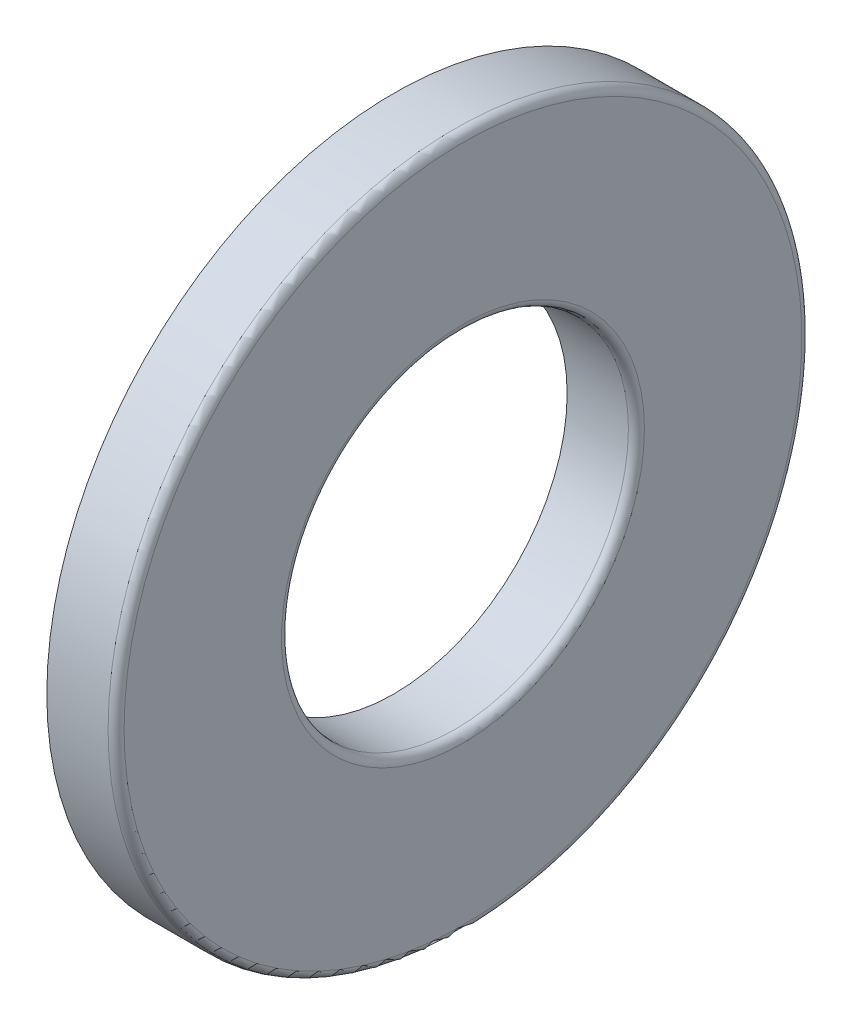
ISO-10303-21;
HEADER;
FILE_DESCRIPTION(('STEP AP214'),'2;1');
FILE_NAME('part.step','',(''),(''),'','','');
FILE_SCHEMA(('AUTOMOTIVE_DESIGN { 1 0 10303 214 1 1 1 1 }'));
ENDSEC;
DATA;
#1=APPLICATION_CONTEXT('core data for automotive mechanical design processes');
#2=APPLICATION_PROTOCOL_DEFINITION('international standard','automotive_design',2000,#1);
#3=PRODUCT_CONTEXT('',#1,'mechanical');
#4=PRODUCT('Part','Part','',(#3));
#5=PRODUCT_RELATED_PRODUCT_CATEGORY('part','',(#4));
#6=PRODUCT_DEFINITION_FORMATION('','',#4);
#7=PRODUCT_DEFINITION_CONTEXT('part definition',#1,'design');
#8=PRODUCT_DEFINITION('design','',#6,#7);
#9=PRODUCT_DEFINITION_SHAPE('','',#8);
#10=(LENGTH_UNIT() NAMED_UNIT(*) SI_UNIT(.MILLI.,.METRE.));
#11=(NAMED_UNIT(*) PLANE_ANGLE_UNIT() SI_UNIT($,.RADIAN.));
#12=(NAMED_UNIT(*) SI_UNIT($,.STERADIAN.) SOLID_ANGLE_UNIT());
#13=UNCERTAINTY_MEASURE_WITH_UNIT(LENGTH_MEASURE(1.E-05),#10,'distance_accuracy_value','');
#14=(GEOMETRIC_REPRESENTATION_CONTEXT(3) GLOBAL_UNCERTAINTY_ASSIGNED_CONTEXT((#13)) GLOBAL_UNIT_ASSIGNED_CONTEXT((#10,
#11,#12)) REPRESENTATION_CONTEXT('',''));
#15=CARTESIAN_POINT('',(0.,0.,0.));
#16=DIRECTION('',(0.,0.,1.));
#17=DIRECTION('',(1.,0.,0.));
#18=AXIS2_PLACEMENT_3D('',#15,#16,#17);
#19=CARTESIAN_POINT('',(6.4048,-13.2414924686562,-13.));
#20=DIRECTION('',(-1.,0.,0.));
#21=DIRECTION('',(0.,0.,1.));
#22=AXIS2_PLACEMENT_3D('',#19,#20,#21);
#23=PLANE('',#22);
#24=CARTESIAN_POINT('',(6.4048,0.,0.));
#25=DIRECTION('',(-1.,0.,0.));
#26=DIRECTION('',(0.,0.,-1.));
#27=AXIS2_PLACEMENT_3D('',#24,#25,#26);
#28=CIRCLE('',#27,13.);
#29=CARTESIAN_POINT('',(6.4048,0.,-13.));
#30=VERTEX_POINT('',#29);
#31=EDGE_CURVE('E44',#30,#30,#28,.F.);
#32=ORIENTED_EDGE('',*,*,#31,.F.);
#33=EDGE_LOOP('',(#32));
#34=FACE_BOUND('',#33,.T.);
#35=CARTESIAN_POINT('',(6.4048,0.,0.));
#36=DIRECTION('',(1.,0.,0.));
#37=DIRECTION('',(0.,0.,1.));
#38=AXIS2_PLACEMENT_3D('',#35,#36,#37);
#39=CIRCLE('',#38,10.9286);
#40=CARTESIAN_POINT('',(6.4048,0.,10.9286));
#41=VERTEX_POINT('',#40);
#42=EDGE_CURVE('E41',#41,#41,#39,.T.);
#43=ORIENTED_EDGE('',*,*,#42,.T.);
#44=EDGE_LOOP('',(#43));
#45=FACE_BOUND('',#44,.T.);
#46=ADVANCED_FACE('F15',(#34,#45),#23,.T.);
#47=CARTESIAN_POINT('',(9.,-12.9359195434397,12.7));
#48=DIRECTION('',(1.,0.,0.));
#49=DIRECTION('',(0.,0.,-1.));
#50=AXIS2_PLACEMENT_3D('',#47,#48,#49);
#51=PLANE('',#50);
#52=CARTESIAN_POINT('',(9.,0.,0.));
#53=DIRECTION('',(1.,0.,0.));
#54=DIRECTION('',(0.,-1.16841703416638E-09,1.));
#55=AXIS2_PLACEMENT_3D('',#52,#53,#54);
#56=CIRCLE('',#55,12.700000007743);
#57=CARTESIAN_POINT('',(9.,-1.483889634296E-08,12.700000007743));
#58=VERTEX_POINT('',#57);
#59=EDGE_CURVE('E38',#58,#58,#56,.T.);
#60=ORIENTED_EDGE('',*,*,#59,.T.);
#61=EDGE_LOOP('',(#60));
#62=FACE_BOUND('',#61,.T.);
#63=CARTESIAN_POINT('',(9.,0.,0.));
#64=DIRECTION('',(-1.,0.,0.));
#65=DIRECTION('',(0.,0.,-1.));
#66=AXIS2_PLACEMENT_3D('',#63,#64,#65);
#67=CIRCLE('',#66,6.8);
#68=CARTESIAN_POINT('',(9.,0.,-6.8));
#69=VERTEX_POINT('',#68);
#70=EDGE_CURVE('E35',#69,#69,#67,.F.);
#71=ORIENTED_EDGE('',*,*,#70,.F.);
#72=EDGE_LOOP('',(#71));
#73=FACE_BOUND('',#72,.T.);
#74=ADVANCED_FACE('F53',(#62,#73),#51,.T.);
#75=CARTESIAN_POINT('',(6.4048,-8.2919425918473,-8.0714));
#76=DIRECTION('',(-1.,0.,0.));
#77=DIRECTION('',(0.,0.,1.));
#78=AXIS2_PLACEMENT_3D('',#75,#76,#77);
#79=PLANE('',#78);
#80=CARTESIAN_POINT('',(6.4048,0.,0.));
#81=DIRECTION('',(-1.,0.,0.));
#82=DIRECTION('',(0.,0.,-1.));
#83=AXIS2_PLACEMENT_3D('',#80,#81,#82);
#84=CIRCLE('',#83,8.0714);
#85=CARTESIAN_POINT('',(6.4048,0.,-8.0714));
#86=VERTEX_POINT('',#85);
#87=EDGE_CURVE('E30',#86,#86,#84,.F.);
#88=ORIENTED_EDGE('',*,*,#87,.F.);
#89=EDGE_LOOP('',(#88));
#90=FACE_BOUND('',#89,.T.);
#91=CARTESIAN_POINT('',(6.4048,0.,0.));
#92=DIRECTION('',(1.,0.,0.));
#93=DIRECTION('',(0.,0.,1.));
#94=AXIS2_PLACEMENT_3D('',#91,#92,#93);
#95=CIRCLE('',#94,6.5);
#96=CARTESIAN_POINT('',(6.4048,0.,6.5));
#97=VERTEX_POINT('',#96);
#98=EDGE_CURVE('E26',#97,#97,#95,.T.);
#99=ORIENTED_EDGE('',*,*,#98,.T.);
#100=EDGE_LOOP('',(#99));
#101=FACE_BOUND('',#100,.T.);
#102=ADVANCED_FACE('F60',(#90,#101),#79,.T.);
#103=CARTESIAN_POINT('',(4.5,0.,0.));
#104=DIRECTION('',(1.,0.,0.));
#105=DIRECTION('',(0.,0.,1.));
#106=AXIS2_PLACEMENT_3D('',#103,#104,#105);
#107=TOROIDAL_SURFACE('',#106,9.5,2.381);
#108=ORIENTED_EDGE('',*,*,#42,.F.);
#109=EDGE_LOOP('',(#108));
#110=FACE_BOUND('',#109,.T.);
#111=ORIENTED_EDGE('',*,*,#87,.T.);
#112=EDGE_LOOP('',(#111));
#113=FACE_BOUND('',#112,.T.);
#114=ADVANCED_FACE('F57',(#110,#113),#107,.F.);
#115=CARTESIAN_POINT('',(8.7,0.,0.));
#116=DIRECTION('',(1.,0.,0.));
#117=DIRECTION('',(0.,0.,1.));
#118=AXIS2_PLACEMENT_3D('',#115,#116,#117);
#119=CYLINDRICAL_SURFACE('',#118,13.);
#120=ORIENTED_EDGE('',*,*,#31,.T.);
#121=EDGE_LOOP('',(#120));
#122=FACE_BOUND('',#121,.T.);
#123=CARTESIAN_POINT('',(8.7,0.,0.));
#124=DIRECTION('',(-1.,0.,0.));
#125=DIRECTION('',(0.,0.,-1.));
#126=AXIS2_PLACEMENT_3D('',#123,#124,#125);
#127=CIRCLE('',#126,13.);
#128=CARTESIAN_POINT('',(8.7,0.,-13.));
#129=VERTEX_POINT('',#128);
#130=EDGE_CURVE('E22',#129,#129,#127,.F.);
#131=ORIENTED_EDGE('',*,*,#130,.F.);
#132=EDGE_LOOP('',(#131));
#133=FACE_BOUND('',#132,.T.);
#134=ADVANCED_FACE('F48',(#122,#133),#119,.T.);
#135=CARTESIAN_POINT('',(8.70000000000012,0.,0.));
#136=DIRECTION('',(1.,0.,0.));
#137=DIRECTION('',(0.,0.,1.));
#138=AXIS2_PLACEMENT_3D('',#135,#136,#137);
#139=TOROIDAL_SURFACE('',#138,12.7000000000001,0.29999999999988);
#140=ORIENTED_EDGE('',*,*,#130,.T.);
#141=EDGE_LOOP('',(#140));
#142=FACE_BOUND('',#141,.T.);
#143=ORIENTED_EDGE('',*,*,#59,.F.);
#144=EDGE_LOOP('',(#143));
#145=FACE_BOUND('',#144,.T.);
#146=ADVANCED_FACE('F75',(#142,#145),#139,.T.);
#147=CARTESIAN_POINT('',(8.70000000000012,0.,0.));
#148=DIRECTION('',(1.,0.,0.));
#149=DIRECTION('',(0.,0.,1.));
#150=AXIS2_PLACEMENT_3D('',#147,#148,#149);
#151=TOROIDAL_SURFACE('',#150,6.79999999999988,0.299999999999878);
#152=ORIENTED_EDGE('',*,*,#70,.T.);
#153=EDGE_LOOP('',(#152));
#154=FACE_BOUND('',#153,.T.);
#155=CARTESIAN_POINT('',(8.7,0.,0.));
#156=DIRECTION('',(-1.,0.,0.));
#157=DIRECTION('',(0.,0.,-1.));
#158=AXIS2_PLACEMENT_3D('',#155,#156,#157);
#159=CIRCLE('',#158,6.5);
#160=CARTESIAN_POINT('',(8.7,0.,-6.5));
#161=VERTEX_POINT('',#160);
#162=EDGE_CURVE('E10',#161,#161,#159,.F.);
#163=ORIENTED_EDGE('',*,*,#162,.F.);
#164=EDGE_LOOP('',(#163));
#165=FACE_BOUND('',#164,.T.);
#166=ADVANCED_FACE('F70',(#154,#165),#151,.T.);
#167=CARTESIAN_POINT('',(8.7,0.,0.));
#168=DIRECTION('',(1.,0.,0.));
#169=DIRECTION('',(0.,0.,1.));
#170=AXIS2_PLACEMENT_3D('',#167,#168,#169);
#171=CYLINDRICAL_SURFACE('',#170,6.5);
#172=ORIENTED_EDGE('',*,*,#162,.T.);
#173=EDGE_LOOP('',(#172));
#174=FACE_BOUND('',#173,.T.);
#175=ORIENTED_EDGE('',*,*,#98,.F.);
#176=EDGE_LOOP('',(#175));
#177=FACE_BOUND('',#176,.T.);
#178=ADVANCED_FACE('F17',(#174,#177),#171,.F.);
#179=CLOSED_SHELL('',(#46,#74,#102,#114,#134,#146,#166,#178));
#180=MANIFOLD_SOLID_BREP('B1',#179);
#181=ADVANCED_BREP_SHAPE_REPRESENTATION('',(#18,#180),#14);
#182=SHAPE_DEFINITION_REPRESENTATION(#9,#181);
ENDSEC;
END-ISO-10303-21;
